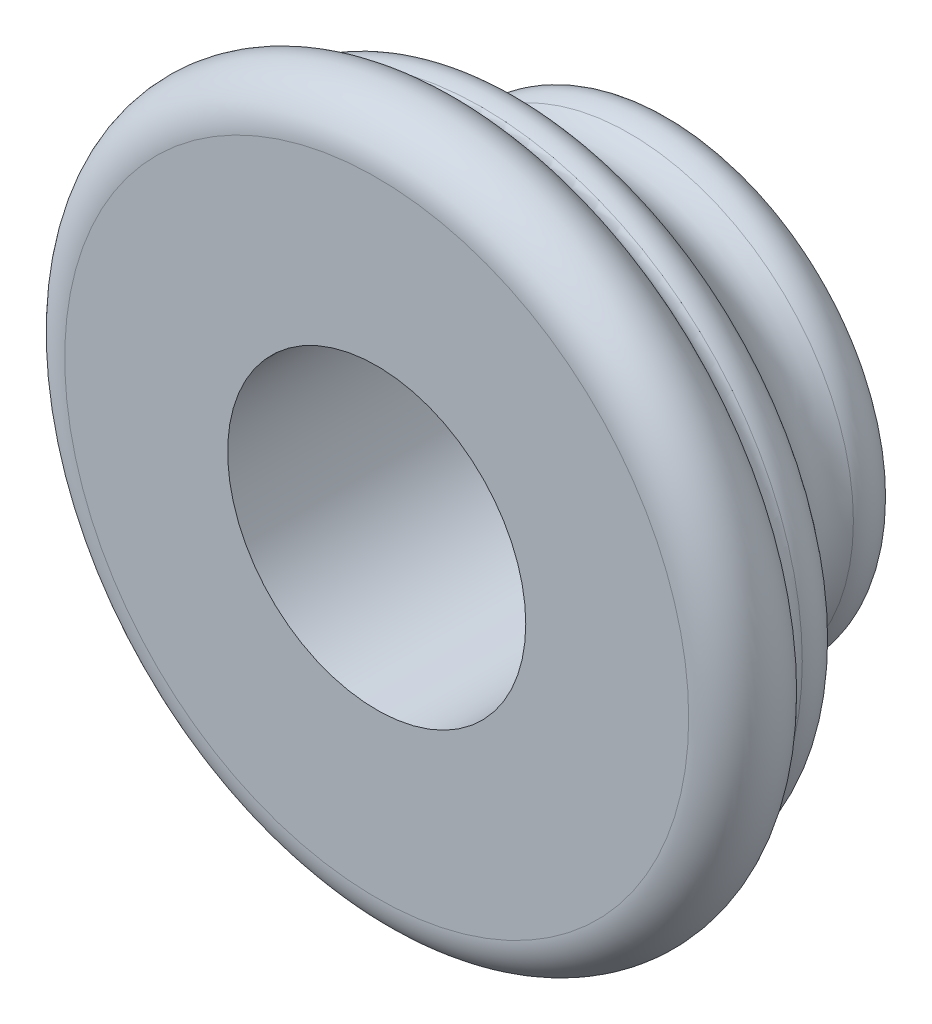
ISO-10303-21;
HEADER;
FILE_DESCRIPTION(('STEP AP214'),'2;1');
FILE_NAME('part.step','',(''),(''),'','','');
FILE_SCHEMA(('AUTOMOTIVE_DESIGN { 1 0 10303 214 1 1 1 1 }'));
ENDSEC;
DATA;
#1=APPLICATION_CONTEXT('core data for automotive mechanical design processes');
#2=APPLICATION_PROTOCOL_DEFINITION('international standard','automotive_design',2000,#1);
#3=PRODUCT_CONTEXT('',#1,'mechanical');
#4=PRODUCT('Part','Part','',(#3));
#5=PRODUCT_RELATED_PRODUCT_CATEGORY('part','',(#4));
#6=PRODUCT_DEFINITION_FORMATION('','',#4);
#7=PRODUCT_DEFINITION_CONTEXT('part definition',#1,'design');
#8=PRODUCT_DEFINITION('design','',#6,#7);
#9=PRODUCT_DEFINITION_SHAPE('','',#8);
#10=(LENGTH_UNIT() NAMED_UNIT(*) SI_UNIT(.MILLI.,.METRE.));
#11=(NAMED_UNIT(*) PLANE_ANGLE_UNIT() SI_UNIT($,.RADIAN.));
#12=(NAMED_UNIT(*) SI_UNIT($,.STERADIAN.) SOLID_ANGLE_UNIT());
#13=UNCERTAINTY_MEASURE_WITH_UNIT(LENGTH_MEASURE(1.E-05),#10,'distance_accuracy_value','');
#14=(GEOMETRIC_REPRESENTATION_CONTEXT(3) GLOBAL_UNCERTAINTY_ASSIGNED_CONTEXT((#13)) GLOBAL_UNIT_ASSIGNED_CONTEXT((#10,
#11,#12)) REPRESENTATION_CONTEXT('',''));
#15=CARTESIAN_POINT('',(0.,0.,0.));
#16=DIRECTION('',(0.,0.,1.));
#17=DIRECTION('',(1.,0.,0.));
#18=AXIS2_PLACEMENT_3D('',#15,#16,#17);
#19=CARTESIAN_POINT('',(0.,0.,-9.));
#20=DIRECTION('',(0.,0.,1.));
#21=DIRECTION('',(1.,0.,0.));
#22=AXIS2_PLACEMENT_3D('',#19,#20,#21);
#23=TOROIDAL_SURFACE('',#22,6.655,1.);
#24=CARTESIAN_POINT('',(0.,0.,-8.48042255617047));
#25=DIRECTION('',(0.,0.,1.));
#26=DIRECTION('',(1.,0.,0.));
#27=AXIS2_PLACEMENT_3D('',#24,#25,#26);
#28=CIRCLE('',#27,7.50942336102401);
#29=CARTESIAN_POINT('',(7.50942336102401,0.,-8.48042255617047));
#30=VERTEX_POINT('',#29);
#31=EDGE_CURVE('E10',#30,#30,#28,.T.);
#32=ORIENTED_EDGE('',*,*,#31,.F.);
#33=EDGE_LOOP('',(#32));
#34=FACE_BOUND('',#33,.T.);
#35=CARTESIAN_POINT('',(0.,0.,-10.));
#36=DIRECTION('',(0.,0.,1.));
#37=DIRECTION('',(1.,0.,0.));
#38=AXIS2_PLACEMENT_3D('',#35,#36,#37);
#39=CIRCLE('',#38,6.655);
#40=CARTESIAN_POINT('',(6.655,0.,-10.));
#41=VERTEX_POINT('',#40);
#42=EDGE_CURVE('E57',#41,#41,#39,.T.);
#43=ORIENTED_EDGE('',*,*,#42,.T.);
#44=EDGE_LOOP('',(#43));
#45=FACE_BOUND('',#44,.T.);
#46=ADVANCED_FACE('F29',(#34,#45),#23,.T.);
#47=CARTESIAN_POINT('',(0.,7.50942336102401,-8.48042255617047));
#48=CARTESIAN_POINT('',(0.,6.71519255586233,-7.1743432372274));
#49=CARTESIAN_POINT('',(0.,7.92956202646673,-6.21062617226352));
#50=CARTESIAN_POINT('',(0.,10.3177186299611,-4.76548351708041));
#51=B_SPLINE_CURVE_WITH_KNOTS('',3,(#47,#48,#49,#50),.UNSPECIFIED.,.F.,.F.,(4,4),(0.,1.),.UNSPECIFIED.);
#52=CARTESIAN_POINT('',(0.,0.,7.07917110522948));
#53=DIRECTION('',(0.,0.,1.));
#54=AXIS1_PLACEMENT('',#52,#53);
#55=SURFACE_OF_REVOLUTION('',#51,#54);
#56=CARTESIAN_POINT('',(0.,0.,-4.76548351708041));
#57=DIRECTION('',(0.,0.,1.));
#58=DIRECTION('',(1.,0.,0.));
#59=AXIS2_PLACEMENT_3D('',#56,#57,#58);
#60=CIRCLE('',#59,10.3177186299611);
#61=CARTESIAN_POINT('',(10.3177186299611,0.,-4.76548351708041));
#62=VERTEX_POINT('',#61);
#63=EDGE_CURVE('E35',#62,#62,#60,.T.);
#64=ORIENTED_EDGE('',*,*,#63,.F.);
#65=EDGE_LOOP('',(#64));
#66=FACE_BOUND('',#65,.T.);
#67=ORIENTED_EDGE('',*,*,#31,.T.);
#68=EDGE_LOOP('',(#67));
#69=FACE_BOUND('',#68,.T.);
#70=ADVANCED_FACE('F66',(#66,#69),#55,.T.);
#71=CARTESIAN_POINT('',(0.,0.,-3.90993257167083));
#72=DIRECTION('',(0.,0.,1.));
#73=DIRECTION('',(1.,0.,0.));
#74=AXIS2_PLACEMENT_3D('',#71,#72,#73);
#75=TOROIDAL_SURFACE('',#74,9.8,0.999999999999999);
#76=CARTESIAN_POINT('',(0.,0.,-3.54434875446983));
#77=DIRECTION('',(0.,0.,1.));
#78=DIRECTION('',(1.,0.,0.));
#79=AXIS2_PLACEMENT_3D('',#76,#77,#78);
#80=CIRCLE('',#79,10.7307784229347);
#81=CARTESIAN_POINT('',(10.7307784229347,0.,-3.54434875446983));
#82=VERTEX_POINT('',#81);
#83=EDGE_CURVE('E39',#82,#82,#80,.T.);
#84=ORIENTED_EDGE('',*,*,#83,.F.);
#85=EDGE_LOOP('',(#84));
#86=FACE_BOUND('',#85,.T.);
#87=ORIENTED_EDGE('',*,*,#63,.T.);
#88=EDGE_LOOP('',(#87));
#89=FACE_BOUND('',#88,.T.);
#90=ADVANCED_FACE('F69',(#86,#89),#75,.T.);
#91=CARTESIAN_POINT('',(0.,0.,-3.36155684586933));
#92=DIRECTION('',(0.,0.,1.));
#93=DIRECTION('',(1.,0.,0.));
#94=AXIS2_PLACEMENT_3D('',#91,#92,#93);
#95=TOROIDAL_SURFACE('',#94,11.196167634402,0.500000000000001);
#96=CARTESIAN_POINT('',(0.,0.,-2.896167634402));
#97=DIRECTION('',(0.,0.,1.));
#98=DIRECTION('',(1.,0.,0.));
#99=AXIS2_PLACEMENT_3D('',#96,#97,#98);
#100=CIRCLE('',#99,11.0133757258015);
#101=CARTESIAN_POINT('',(11.0133757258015,0.,-2.896167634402));
#102=VERTEX_POINT('',#101);
#103=EDGE_CURVE('E43',#102,#102,#100,.T.);
#104=ORIENTED_EDGE('',*,*,#103,.F.);
#105=EDGE_LOOP('',(#104));
#106=FACE_BOUND('',#105,.T.);
#107=ORIENTED_EDGE('',*,*,#83,.T.);
#108=EDGE_LOOP('',(#107));
#109=FACE_BOUND('',#108,.T.);
#110=ADVANCED_FACE('F73',(#106,#109),#95,.F.);
#111=CARTESIAN_POINT('',(0.,0.,-1.5));
#112=DIRECTION('',(0.,0.,1.));
#113=DIRECTION('',(1.,0.,0.));
#114=AXIS2_PLACEMENT_3D('',#111,#112,#113);
#115=TOROIDAL_SURFACE('',#114,10.465,1.5);
#116=CARTESIAN_POINT('',(0.,0.,0.));
#117=DIRECTION('',(0.,0.,1.));
#118=DIRECTION('',(1.,0.,0.));
#119=AXIS2_PLACEMENT_3D('',#116,#117,#118);
#120=CIRCLE('',#119,10.465);
#121=CARTESIAN_POINT('',(10.465,0.,0.));
#122=VERTEX_POINT('',#121);
#123=EDGE_CURVE('E48',#122,#122,#120,.T.);
#124=ORIENTED_EDGE('',*,*,#123,.F.);
#125=EDGE_LOOP('',(#124));
#126=FACE_BOUND('',#125,.T.);
#127=ORIENTED_EDGE('',*,*,#103,.T.);
#128=EDGE_LOOP('',(#127));
#129=FACE_BOUND('',#128,.T.);
#130=ADVANCED_FACE('F77',(#126,#129),#115,.T.);
#131=CARTESIAN_POINT('',(0.,10.465,0.));
#132=DIRECTION('',(0.,0.,-1.));
#133=DIRECTION('',(-1.,0.,0.));
#134=AXIS2_PLACEMENT_3D('',#131,#132,#133);
#135=PLANE('',#134);
#136=CARTESIAN_POINT('',(0.,0.,0.));
#137=DIRECTION('',(0.,0.,1.));
#138=DIRECTION('',(1.,0.,0.));
#139=AXIS2_PLACEMENT_3D('',#136,#137,#138);
#140=CIRCLE('',#139,5.);
#141=CARTESIAN_POINT('',(5.,0.,0.));
#142=VERTEX_POINT('',#141);
#143=EDGE_CURVE('E51',#142,#142,#140,.T.);
#144=ORIENTED_EDGE('',*,*,#143,.F.);
#145=EDGE_LOOP('',(#144));
#146=FACE_BOUND('',#145,.T.);
#147=ORIENTED_EDGE('',*,*,#123,.T.);
#148=EDGE_LOOP('',(#147));
#149=FACE_BOUND('',#148,.T.);
#150=ADVANCED_FACE('F81',(#146,#149),#135,.F.);
#151=CARTESIAN_POINT('',(0.,0.,7.07917110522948));
#152=DIRECTION('',(0.,0.,1.));
#153=DIRECTION('',(1.,0.,0.));
#154=AXIS2_PLACEMENT_3D('',#151,#152,#153);
#155=CYLINDRICAL_SURFACE('',#154,5.);
#156=CARTESIAN_POINT('',(0.,0.,-10.));
#157=DIRECTION('',(0.,0.,1.));
#158=DIRECTION('',(1.,0.,0.));
#159=AXIS2_PLACEMENT_3D('',#156,#157,#158);
#160=CIRCLE('',#159,5.);
#161=CARTESIAN_POINT('',(5.,0.,-10.));
#162=VERTEX_POINT('',#161);
#163=EDGE_CURVE('E54',#162,#162,#160,.T.);
#164=ORIENTED_EDGE('',*,*,#163,.F.);
#165=EDGE_LOOP('',(#164));
#166=FACE_BOUND('',#165,.T.);
#167=ORIENTED_EDGE('',*,*,#143,.T.);
#168=EDGE_LOOP('',(#167));
#169=FACE_BOUND('',#168,.T.);
#170=ADVANCED_FACE('F85',(#166,#169),#155,.F.);
#171=CARTESIAN_POINT('',(0.,6.655,-10.));
#172=DIRECTION('',(0.,0.,1.));
#173=DIRECTION('',(1.,0.,0.));
#174=AXIS2_PLACEMENT_3D('',#171,#172,#173);
#175=PLANE('',#174);
#176=ORIENTED_EDGE('',*,*,#42,.F.);
#177=EDGE_LOOP('',(#176));
#178=FACE_BOUND('',#177,.T.);
#179=ORIENTED_EDGE('',*,*,#163,.T.);
#180=EDGE_LOOP('',(#179));
#181=FACE_BOUND('',#180,.T.);
#182=ADVANCED_FACE('F89',(#178,#181),#175,.F.);
#183=CLOSED_SHELL('',(#46,#70,#90,#110,#130,#150,#170,#182));
#184=MANIFOLD_SOLID_BREP('B2',#183);
#185=ADVANCED_BREP_SHAPE_REPRESENTATION('',(#18,#184),#14);
#186=SHAPE_DEFINITION_REPRESENTATION(#9,#185);
ENDSEC;
END-ISO-10303-21;
